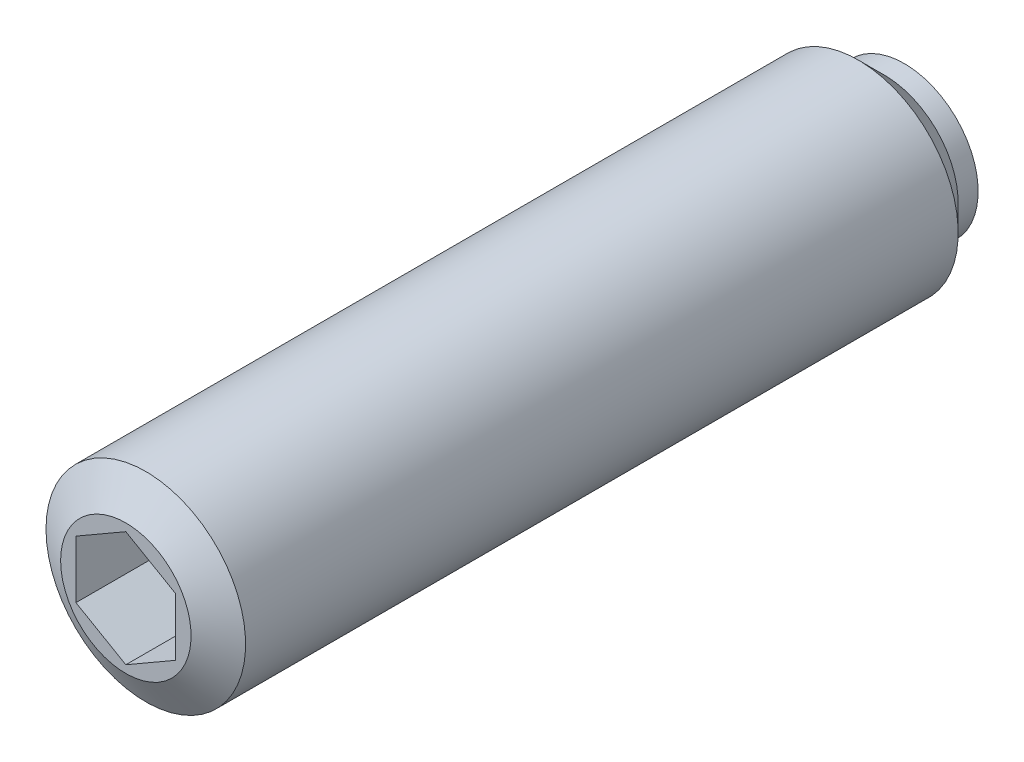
ISO-10303-21;
HEADER;
FILE_DESCRIPTION(('STEP AP214'),'2;1');
FILE_NAME('part.step','',(''),(''),'','','');
FILE_SCHEMA(('AUTOMOTIVE_DESIGN { 1 0 10303 214 1 1 1 1 }'));
ENDSEC;
DATA;
#1=APPLICATION_CONTEXT('core data for automotive mechanical design processes');
#2=APPLICATION_PROTOCOL_DEFINITION('international standard','automotive_design',2000,#1);
#3=PRODUCT_CONTEXT('',#1,'mechanical');
#4=PRODUCT('Part','Part','',(#3));
#5=PRODUCT_RELATED_PRODUCT_CATEGORY('part','',(#4));
#6=PRODUCT_DEFINITION_FORMATION('','',#4);
#7=PRODUCT_DEFINITION_CONTEXT('part definition',#1,'design');
#8=PRODUCT_DEFINITION('design','',#6,#7);
#9=PRODUCT_DEFINITION_SHAPE('','',#8);
#10=(LENGTH_UNIT() NAMED_UNIT(*) SI_UNIT(.MILLI.,.METRE.));
#11=(NAMED_UNIT(*) PLANE_ANGLE_UNIT() SI_UNIT($,.RADIAN.));
#12=(NAMED_UNIT(*) SI_UNIT($,.STERADIAN.) SOLID_ANGLE_UNIT());
#13=UNCERTAINTY_MEASURE_WITH_UNIT(LENGTH_MEASURE(1.E-05),#10,'distance_accuracy_value','');
#14=(GEOMETRIC_REPRESENTATION_CONTEXT(3) GLOBAL_UNCERTAINTY_ASSIGNED_CONTEXT((#13)) GLOBAL_UNIT_ASSIGNED_CONTEXT((#10,
#11,#12)) REPRESENTATION_CONTEXT('',''));
#15=CARTESIAN_POINT('',(0.,0.,0.));
#16=DIRECTION('',(0.,0.,1.));
#17=DIRECTION('',(1.,0.,0.));
#18=AXIS2_PLACEMENT_3D('',#15,#16,#17);
#19=CARTESIAN_POINT('',(0.,1.01980390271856,0.));
#20=DIRECTION('',(0.,0.,1.));
#21=DIRECTION('',(-1.,0.,0.));
#22=AXIS2_PLACEMENT_3D('',#19,#20,#21);
#23=PLANE('',#22);
#24=CARTESIAN_POINT('',(0.,0.,0.));
#25=DIRECTION('',(0.,0.,1.));
#26=DIRECTION('',(-1.,0.,0.));
#27=AXIS2_PLACEMENT_3D('',#24,#25,#26);
#28=CIRCLE('',#27,1.01980390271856);
#29=CARTESIAN_POINT('',(0.,1.01980390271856,0.));
#30=VERTEX_POINT('',#29);
#31=EDGE_CURVE('E9',#30,#30,#28,.T.);
#32=ORIENTED_EDGE('',*,*,#31,.F.);
#33=EDGE_LOOP('',(#32));
#34=FACE_BOUND('',#33,.T.);
#35=ADVANCED_FACE('F14',(#34),#23,.F.);
#36=CARTESIAN_POINT('',(0.,0.,1.1));
#37=DIRECTION('',(0.,0.,1.));
#38=DIRECTION('',(0.,1.,0.));
#39=AXIS2_PLACEMENT_3D('',#36,#37,#38);
#40=SPHERICAL_SURFACE('',#39,1.5);
#41=CARTESIAN_POINT('',(0.,0.,0.3));
#42=DIRECTION('',(0.,0.,1.));
#43=DIRECTION('',(-1.,0.,0.));
#44=AXIS2_PLACEMENT_3D('',#41,#42,#43);
#45=CIRCLE('',#44,1.26885775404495);
#46=CARTESIAN_POINT('',(0.,1.26885775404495,0.3));
#47=VERTEX_POINT('',#46);
#48=EDGE_CURVE('E21',#47,#47,#45,.T.);
#49=CARTESIAN_POINT('',(0.,1.26885775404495,0.3));
#50=CARTESIAN_POINT('',(0.,1.26668545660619,0.296554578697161));
#51=CARTESIAN_POINT('',(0.,1.26449912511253,0.293118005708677));
#52=CARTESIAN_POINT('',(0.,1.26009854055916,0.286262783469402));
#53=CARTESIAN_POINT('',(0.,1.25788428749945,0.28284413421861));
#54=CARTESIAN_POINT('',(0.,1.25342800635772,0.276024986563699));
#55=CARTESIAN_POINT('',(0.,1.2511859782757,0.27262448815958));
#56=CARTESIAN_POINT('',(0.,1.24667429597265,0.265841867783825));
#57=CARTESIAN_POINT('',(0.,1.24440464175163,0.26245974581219));
#58=CARTESIAN_POINT('',(0.,1.23983785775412,0.255714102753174));
#59=CARTESIAN_POINT('',(0.,1.23754072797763,0.252350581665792));
#60=CARTESIAN_POINT('',(0.,1.23291914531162,0.245642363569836));
#61=CARTESIAN_POINT('',(0.,1.23059469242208,0.242297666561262));
#62=CARTESIAN_POINT('',(0.,1.22591861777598,0.235627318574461));
#63=CARTESIAN_POINT('',(0.,1.2235669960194,0.232301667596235));
#64=CARTESIAN_POINT('',(0.,1.21883673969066,0.225669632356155));
#65=CARTESIAN_POINT('',(0.,1.2164581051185,0.222363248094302));
#66=CARTESIAN_POINT('',(0.,1.21167398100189,0.215769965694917));
#67=CARTESIAN_POINT('',(0.,1.20926849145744,0.212483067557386));
#68=CARTESIAN_POINT('',(0.,1.20443081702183,0.205928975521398));
#69=CARTESIAN_POINT('',(0.,1.20199863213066,0.202661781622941));
#70=CARTESIAN_POINT('',(0.,1.19710772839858,0.196147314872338));
#71=CARTESIAN_POINT('',(0.,1.19464900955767,0.192900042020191));
#72=CARTESIAN_POINT('',(0.,1.18970520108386,0.186425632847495));
#73=CARTESIAN_POINT('',(0.,1.18722011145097,0.183198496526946));
#74=CARTESIAN_POINT('',(0.,1.18222372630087,0.176764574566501));
#75=CARTESIAN_POINT('',(0.,1.17971243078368,0.173557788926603));
#76=CARTESIAN_POINT('',(0.,1.17466380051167,0.167164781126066));
#77=CARTESIAN_POINT('',(0.,1.17212646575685,0.163978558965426));
#78=CARTESIAN_POINT('',(0.,1.16702592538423,0.157626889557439));
#79=CARTESIAN_POINT('',(0.,1.16446271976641,0.154461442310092));
#80=CARTESIAN_POINT('',(0.,1.15931060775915,0.148151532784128));
#81=CARTESIAN_POINT('',(0.,1.15672170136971,0.145007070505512));
#82=CARTESIAN_POINT('',(0.,1.15151835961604,0.138739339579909));
#83=CARTESIAN_POINT('',(0.,1.14890392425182,0.135616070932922));
#84=CARTESIAN_POINT('',(0.,1.14364969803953,0.129390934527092));
#85=CARTESIAN_POINT('',(0.,1.14100990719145,0.126289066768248));
#86=CARTESIAN_POINT('',(0.,1.13570514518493,0.120106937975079));
#87=CARTESIAN_POINT('',(0.,1.13304017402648,0.117026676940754));
#88=CARTESIAN_POINT('',(0.,1.12768522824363,0.1108879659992));
#89=CARTESIAN_POINT('',(0.,1.12499525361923,0.107829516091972));
#90=CARTESIAN_POINT('',(0.,1.1195904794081,0.101734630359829));
#91=CARTESIAN_POINT('',(0.,1.11687567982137,0.0986981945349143));
#92=CARTESIAN_POINT('',(0.,1.11142143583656,0.0926475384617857));
#93=CARTESIAN_POINT('',(0.,1.10868199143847,0.0896333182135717));
#94=CARTESIAN_POINT('',(0.,1.10317863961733,0.0836272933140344));
#95=CARTESIAN_POINT('',(0.,1.10041473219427,0.080635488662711));
#96=CARTESIAN_POINT('',(0.,1.09486263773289,0.0746744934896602));
#97=CARTESIAN_POINT('',(0.,1.09207445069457,0.0717053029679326));
#98=CARTESIAN_POINT('',(0.,1.08647398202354,0.0657897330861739));
#99=CARTESIAN_POINT('',(0.,1.08366170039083,0.0628433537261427));
#100=CARTESIAN_POINT('',(0.,1.07801322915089,0.0569736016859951));
#101=CARTESIAN_POINT('',(0.,1.07517703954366,0.0540502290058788));
#102=CARTESIAN_POINT('',(0.,1.06948094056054,0.0482266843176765));
#103=CARTESIAN_POINT('',(0.,1.06662103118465,0.0453265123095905));
#104=CARTESIAN_POINT('',(0.,1.06087768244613,0.0395495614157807));
#105=CARTESIAN_POINT('',(0.,1.0579942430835,0.036672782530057));
#106=CARTESIAN_POINT('',(0.,1.0522040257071,0.0309428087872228));
#107=CARTESIAN_POINT('',(0.,1.04929724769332,0.0280896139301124));
#108=CARTESIAN_POINT('',(0.,1.04346054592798,0.0224069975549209));
#109=CARTESIAN_POINT('',(0.,1.0405306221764,0.01957757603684));
#110=CARTESIAN_POINT('',(0.,1.03464782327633,0.013942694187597));
#111=CARTESIAN_POINT('',(0.,1.03169494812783,0.011137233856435));
#112=CARTESIAN_POINT('',(0.,1.02576644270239,0.00555046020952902));
#113=CARTESIAN_POINT('',(0.,1.02279081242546,0.00276914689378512));
#114=CARTESIAN_POINT('',(0.,1.01980390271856,0.));
#115=B_SPLINE_CURVE_WITH_KNOTS('',3,(#49,#50,#51,#52,#53,#54,#55,#56,#57,#58,#59,#60,#61,#62,
#63,#64,#65,#66,#67,#68,#69,#70,#71,#72,#73,#74,#75,#76,#77,#78,#79,#80,#81,#82,#83,#84,#85,#86,
#87,#88,#89,#90,#91,#92,#93,#94,#95,#96,#97,#98,#99,#100,#101,#102,#103,#104,#105,#106,#107,
#108,#109,#110,#111,#112,#113,#114),.UNSPECIFIED.,.F.,.F.,(4,2,2,2,2,2,2,2,2,2,2,2,2,2,2,2,2,2,
2,2,2,2,2,2,2,2,2,2,2,2,2,2,4),(0.,0.0122191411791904,0.0244382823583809,0.0366574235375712,
0.0488765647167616,0.061095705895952,0.0733148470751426,0.0855339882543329,0.0977531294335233,
0.109972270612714,0.122191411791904,0.134410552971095,0.146629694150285,0.158848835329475,
0.171067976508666,0.183287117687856,0.195506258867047,0.207725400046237,0.219944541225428,
0.232163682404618,0.244382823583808,0.256601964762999,0.268821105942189,0.281040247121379,
0.29325938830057,0.30547852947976,0.317697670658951,0.329916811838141,0.342135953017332,
0.354355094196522,0.366574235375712,0.378793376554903,0.391012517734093),.UNSPECIFIED.);
#116=EDGE_CURVE('BSEAM141',#47,#30,#115,.T.);
#117=ORIENTED_EDGE('',*,*,#48,.F.);
#118=ORIENTED_EDGE('',*,*,#31,.T.);
#119=ORIENTED_EDGE('',*,*,#116,.T.);
#120=ORIENTED_EDGE('',*,*,#116,.F.);
#121=EDGE_LOOP('',(#117,#119,#118,#120));
#122=FACE_BOUND('',#121,.T.);
#123=ADVANCED_FACE('F141',(#122),#40,.T.);
#124=CARTESIAN_POINT('',(0.,1.85,0.3));
#125=DIRECTION('',(0.,0.,1.));
#126=DIRECTION('',(-1.,0.,0.));
#127=AXIS2_PLACEMENT_3D('',#124,#125,#126);
#128=PLANE('',#127);
#129=CARTESIAN_POINT('',(0.,0.,0.3));
#130=DIRECTION('',(0.,0.,1.));
#131=DIRECTION('',(-1.,0.,0.));
#132=AXIS2_PLACEMENT_3D('',#129,#130,#131);
#133=CIRCLE('',#132,1.85);
#134=CARTESIAN_POINT('',(-1.85,0.,0.3));
#135=VERTEX_POINT('',#134);
#136=EDGE_CURVE('E134',#135,#135,#133,.T.);
#137=ORIENTED_EDGE('',*,*,#136,.F.);
#138=EDGE_LOOP('',(#137));
#139=FACE_BOUND('',#138,.T.);
#140=ORIENTED_EDGE('',*,*,#48,.T.);
#141=EDGE_LOOP('',(#140));
#142=FACE_BOUND('',#141,.T.);
#143=ADVANCED_FACE('F139',(#139,#142),#128,.F.);
#144=CARTESIAN_POINT('',(0.,0.,21.1950749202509));
#145=DIRECTION('',(0.,0.,1.));
#146=DIRECTION('',(-1.,0.,0.));
#147=AXIS2_PLACEMENT_3D('',#144,#145,#146);
#148=CYLINDRICAL_SURFACE('',#147,1.85);
#149=CARTESIAN_POINT('',(0.,0.,0.8));
#150=DIRECTION('',(0.,0.,1.));
#151=DIRECTION('',(-1.,0.,0.));
#152=AXIS2_PLACEMENT_3D('',#149,#150,#151);
#153=CIRCLE('',#152,1.85);
#154=CARTESIAN_POINT('',(-1.85,0.,0.8));
#155=VERTEX_POINT('',#154);
#156=EDGE_CURVE('E131',#155,#155,#153,.T.);
#157=ORIENTED_EDGE('',*,*,#156,.F.);
#158=EDGE_LOOP('',(#157));
#159=FACE_BOUND('',#158,.T.);
#160=ORIENTED_EDGE('',*,*,#136,.T.);
#161=EDGE_LOOP('',(#160));
#162=FACE_BOUND('',#161,.T.);
#163=ADVANCED_FACE('F164',(#159,#162),#148,.T.);
#164=CARTESIAN_POINT('',(0.,0.,0.8));
#165=DIRECTION('',(0.,0.,1.));
#166=DIRECTION('',(-1.,0.,0.));
#167=AXIS2_PLACEMENT_3D('',#164,#165,#166);
#168=CONICAL_SURFACE('',#167,1.85,0.785398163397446);
#169=CARTESIAN_POINT('',(0.,0.,1.45));
#170=DIRECTION('',(0.,0.,1.));
#171=DIRECTION('',(-1.,0.,0.));
#172=AXIS2_PLACEMENT_3D('',#169,#170,#171);
#173=CIRCLE('',#172,2.5);
#174=CARTESIAN_POINT('',(-2.5,0.,1.45));
#175=VERTEX_POINT('',#174);
#176=EDGE_CURVE('E128',#175,#175,#173,.T.);
#177=ORIENTED_EDGE('',*,*,#176,.F.);
#178=EDGE_LOOP('',(#177));
#179=FACE_BOUND('',#178,.T.);
#180=ORIENTED_EDGE('',*,*,#156,.T.);
#181=EDGE_LOOP('',(#180));
#182=FACE_BOUND('',#181,.T.);
#183=ADVANCED_FACE('F173',(#179,#182),#168,.T.);
#184=CARTESIAN_POINT('',(0.,0.,21.1950749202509));
#185=DIRECTION('',(0.,0.,1.));
#186=DIRECTION('',(-1.,0.,0.));
#187=AXIS2_PLACEMENT_3D('',#184,#185,#186);
#188=CYLINDRICAL_SURFACE('',#187,2.5);
#189=CARTESIAN_POINT('',(0.,0.,19.3));
#190=DIRECTION('',(0.,0.,1.));
#191=DIRECTION('',(-1.,0.,0.));
#192=AXIS2_PLACEMENT_3D('',#189,#190,#191);
#193=CIRCLE('',#192,2.5);
#194=CARTESIAN_POINT('',(-2.5,0.,19.3));
#195=VERTEX_POINT('',#194);
#196=EDGE_CURVE('E125',#195,#195,#193,.T.);
#197=ORIENTED_EDGE('',*,*,#196,.F.);
#198=EDGE_LOOP('',(#197));
#199=FACE_BOUND('',#198,.T.);
#200=ORIENTED_EDGE('',*,*,#176,.T.);
#201=EDGE_LOOP('',(#200));
#202=FACE_BOUND('',#201,.T.);
#203=ADVANCED_FACE('F182',(#199,#202),#188,.T.);
#204=CARTESIAN_POINT('',(0.,0.,19.3));
#205=DIRECTION('',(0.,0.,-1.));
#206=DIRECTION('',(1.,0.,0.));
#207=AXIS2_PLACEMENT_3D('',#204,#205,#206);
#208=CONICAL_SURFACE('',#207,2.5,1.04719755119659);
#209=CARTESIAN_POINT('',(0.,0.,19.8));
#210=DIRECTION('',(0.,0.,1.));
#211=DIRECTION('',(-1.,0.,0.));
#212=AXIS2_PLACEMENT_3D('',#209,#210,#211);
#213=CIRCLE('',#212,1.63397459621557);
#214=CARTESIAN_POINT('',(-1.63397459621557,0.,19.8));
#215=VERTEX_POINT('',#214);
#216=EDGE_CURVE('E116',#215,#215,#213,.T.);
#217=ORIENTED_EDGE('',*,*,#216,.F.);
#218=EDGE_LOOP('',(#217));
#219=FACE_BOUND('',#218,.T.);
#220=ORIENTED_EDGE('',*,*,#196,.T.);
#221=EDGE_LOOP('',(#220));
#222=FACE_BOUND('',#221,.T.);
#223=ADVANCED_FACE('F191',(#219,#222),#208,.T.);
#224=CARTESIAN_POINT('',(0.,0.,19.8));
#225=DIRECTION('',(0.,0.,-1.));
#226=DIRECTION('',(1.,0.,0.));
#227=AXIS2_PLACEMENT_3D('',#224,#225,#226);
#228=PLANE('',#227);
#229=DIRECTION('',(-0.866025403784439,-0.5,0.));
#230=VECTOR('',#229,1.);
#231=CARTESIAN_POINT('',(0.,1.44337567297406,19.8));
#232=LINE('',#231,#230);
#233=CARTESIAN_POINT('',(0.,1.44337567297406,19.8));
#234=VERTEX_POINT('',#233);
#235=CARTESIAN_POINT('',(-1.25,0.721687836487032,19.8));
#236=VERTEX_POINT('',#235);
#237=EDGE_CURVE('E82',#234,#236,#232,.T.);
#238=ORIENTED_EDGE('',*,*,#237,.F.);
#239=DIRECTION('',(-0.866025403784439,0.5,0.));
#240=VECTOR('',#239,1.);
#241=CARTESIAN_POINT('',(1.25,0.721687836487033,19.8));
#242=LINE('',#241,#240);
#243=CARTESIAN_POINT('',(1.25,0.721687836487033,19.8));
#244=VERTEX_POINT('',#243);
#245=EDGE_CURVE('E28',#244,#234,#242,.T.);
#246=ORIENTED_EDGE('',*,*,#245,.F.);
#247=DIRECTION('',(0.,1.,0.));
#248=VECTOR('',#247,1.);
#249=CARTESIAN_POINT('',(1.25,-0.721687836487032,19.8));
#250=LINE('',#249,#248);
#251=CARTESIAN_POINT('',(1.25,-0.721687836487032,19.8));
#252=VERTEX_POINT('',#251);
#253=EDGE_CURVE('E98',#252,#244,#250,.T.);
#254=ORIENTED_EDGE('',*,*,#253,.F.);
#255=DIRECTION('',(0.866025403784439,0.5,0.));
#256=VECTOR('',#255,1.);
#257=CARTESIAN_POINT('',(0.,-1.44337567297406,19.8));
#258=LINE('',#257,#256);
#259=CARTESIAN_POINT('',(0.,-1.44337567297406,19.8));
#260=VERTEX_POINT('',#259);
#261=EDGE_CURVE('E92',#260,#252,#258,.T.);
#262=ORIENTED_EDGE('',*,*,#261,.F.);
#263=DIRECTION('',(0.866025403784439,-0.5,0.));
#264=VECTOR('',#263,1.);
#265=CARTESIAN_POINT('',(-1.25,-0.721687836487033,19.8));
#266=LINE('',#265,#264);
#267=CARTESIAN_POINT('',(-1.25,-0.721687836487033,19.8));
#268=VERTEX_POINT('',#267);
#269=EDGE_CURVE('E90',#268,#260,#266,.T.);
#270=ORIENTED_EDGE('',*,*,#269,.F.);
#271=DIRECTION('',(0.,-1.,0.));
#272=VECTOR('',#271,1.);
#273=CARTESIAN_POINT('',(-1.25,0.721687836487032,19.8));
#274=LINE('',#273,#272);
#275=EDGE_CURVE('E71',#236,#268,#274,.T.);
#276=ORIENTED_EDGE('',*,*,#275,.F.);
#277=EDGE_LOOP('',(#238,#246,#254,#262,#270,#276));
#278=FACE_BOUND('',#277,.T.);
#279=ORIENTED_EDGE('',*,*,#216,.T.);
#280=EDGE_LOOP('',(#279));
#281=FACE_BOUND('',#280,.T.);
#282=ADVANCED_FACE('F86',(#278,#281),#228,.F.);
#283=CARTESIAN_POINT('',(1.25,0.721687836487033,16.8));
#284=DIRECTION('',(0.5,0.866025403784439,0.));
#285=DIRECTION('',(0.866025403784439,-0.5,0.));
#286=AXIS2_PLACEMENT_3D('',#283,#284,#285);
#287=PLANE('',#286);
#288=ORIENTED_EDGE('',*,*,#245,.T.);
#289=DIRECTION('',(0.,0.,1.));
#290=VECTOR('',#289,1.);
#291=CARTESIAN_POINT('',(0.,1.44337567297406,16.8));
#292=LINE('',#291,#290);
#293=CARTESIAN_POINT('',(0.,1.44337567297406,16.8));
#294=VERTEX_POINT('',#293);
#295=EDGE_CURVE('E79',#294,#234,#292,.T.);
#296=ORIENTED_EDGE('',*,*,#295,.F.);
#297=DIRECTION('',(-0.866025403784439,0.5,0.));
#298=VECTOR('',#297,1.);
#299=CARTESIAN_POINT('',(1.25,0.721687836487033,16.8));
#300=LINE('',#299,#298);
#301=CARTESIAN_POINT('',(1.25,0.721687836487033,16.8));
#302=VERTEX_POINT('',#301);
#303=EDGE_CURVE('E100',#302,#294,#300,.T.);
#304=ORIENTED_EDGE('',*,*,#303,.F.);
#305=DIRECTION('',(0.,0.,1.));
#306=VECTOR('',#305,1.);
#307=CARTESIAN_POINT('',(1.25,0.721687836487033,16.8));
#308=LINE('',#307,#306);
#309=EDGE_CURVE('E35',#302,#244,#308,.T.);
#310=ORIENTED_EDGE('',*,*,#309,.T.);
#311=EDGE_LOOP('',(#288,#296,#304,#310));
#312=FACE_BOUND('',#311,.T.);
#313=ADVANCED_FACE('F208',(#312),#287,.F.);
#314=CARTESIAN_POINT('',(1.25,-0.721687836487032,16.8));
#315=DIRECTION('',(1.,0.,0.));
#316=DIRECTION('',(0.,-1.,0.));
#317=AXIS2_PLACEMENT_3D('',#314,#315,#316);
#318=PLANE('',#317);
#319=ORIENTED_EDGE('',*,*,#253,.T.);
#320=ORIENTED_EDGE('',*,*,#309,.F.);
#321=DIRECTION('',(0.,1.,0.));
#322=VECTOR('',#321,1.);
#323=CARTESIAN_POINT('',(1.25,-0.721687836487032,16.8));
#324=LINE('',#323,#322);
#325=CARTESIAN_POINT('',(1.25,-0.721687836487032,16.8));
#326=VERTEX_POINT('',#325);
#327=EDGE_CURVE('E112',#326,#302,#324,.T.);
#328=ORIENTED_EDGE('',*,*,#327,.F.);
#329=DIRECTION('',(0.,0.,1.));
#330=VECTOR('',#329,1.);
#331=CARTESIAN_POINT('',(1.25,-0.721687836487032,16.8));
#332=LINE('',#331,#330);
#333=EDGE_CURVE('E117',#326,#252,#332,.T.);
#334=ORIENTED_EDGE('',*,*,#333,.T.);
#335=EDGE_LOOP('',(#319,#320,#328,#334));
#336=FACE_BOUND('',#335,.T.);
#337=ADVANCED_FACE('F216',(#336),#318,.F.);
#338=CARTESIAN_POINT('',(0.,-1.44337567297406,16.8));
#339=DIRECTION('',(0.5,-0.866025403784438,0.));
#340=DIRECTION('',(-0.866025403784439,-0.5,0.));
#341=AXIS2_PLACEMENT_3D('',#338,#339,#340);
#342=PLANE('',#341);
#343=ORIENTED_EDGE('',*,*,#261,.T.);
#344=ORIENTED_EDGE('',*,*,#333,.F.);
#345=DIRECTION('',(0.866025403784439,0.5,0.));
#346=VECTOR('',#345,1.);
#347=CARTESIAN_POINT('',(0.,-1.44337567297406,16.8));
#348=LINE('',#347,#346);
#349=CARTESIAN_POINT('',(0.,-1.44337567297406,16.8));
#350=VERTEX_POINT('',#349);
#351=EDGE_CURVE('E109',#350,#326,#348,.T.);
#352=ORIENTED_EDGE('',*,*,#351,.F.);
#353=DIRECTION('',(0.,0.,1.));
#354=VECTOR('',#353,1.);
#355=CARTESIAN_POINT('',(0.,-1.44337567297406,16.8));
#356=LINE('',#355,#354);
#357=EDGE_CURVE('E119',#350,#260,#356,.T.);
#358=ORIENTED_EDGE('',*,*,#357,.T.);
#359=EDGE_LOOP('',(#343,#344,#352,#358));
#360=FACE_BOUND('',#359,.T.);
#361=ADVANCED_FACE('F224',(#360),#342,.F.);
#362=CARTESIAN_POINT('',(-1.25,-0.721687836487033,16.8));
#363=DIRECTION('',(-0.5,-0.866025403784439,0.));
#364=DIRECTION('',(-0.866025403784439,0.5,0.));
#365=AXIS2_PLACEMENT_3D('',#362,#363,#364);
#366=PLANE('',#365);
#367=ORIENTED_EDGE('',*,*,#269,.T.);
#368=ORIENTED_EDGE('',*,*,#357,.F.);
#369=DIRECTION('',(0.866025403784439,-0.5,0.));
#370=VECTOR('',#369,1.);
#371=CARTESIAN_POINT('',(-1.25,-0.721687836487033,16.8));
#372=LINE('',#371,#370);
#373=CARTESIAN_POINT('',(-1.25,-0.721687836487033,16.8));
#374=VERTEX_POINT('',#373);
#375=EDGE_CURVE('E106',#374,#350,#372,.T.);
#376=ORIENTED_EDGE('',*,*,#375,.F.);
#377=DIRECTION('',(0.,0.,1.));
#378=VECTOR('',#377,1.);
#379=CARTESIAN_POINT('',(-1.25,-0.721687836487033,16.8));
#380=LINE('',#379,#378);
#381=EDGE_CURVE('E78',#374,#268,#380,.T.);
#382=ORIENTED_EDGE('',*,*,#381,.T.);
#383=EDGE_LOOP('',(#367,#368,#376,#382));
#384=FACE_BOUND('',#383,.T.);
#385=ADVANCED_FACE('F232',(#384),#366,.F.);
#386=CARTESIAN_POINT('',(-1.25,0.721687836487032,16.8));
#387=DIRECTION('',(-1.,0.,0.));
#388=DIRECTION('',(0.,1.,0.));
#389=AXIS2_PLACEMENT_3D('',#386,#387,#388);
#390=PLANE('',#389);
#391=ORIENTED_EDGE('',*,*,#275,.T.);
#392=ORIENTED_EDGE('',*,*,#381,.F.);
#393=DIRECTION('',(0.,-1.,0.));
#394=VECTOR('',#393,1.);
#395=CARTESIAN_POINT('',(-1.25,0.721687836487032,16.8));
#396=LINE('',#395,#394);
#397=CARTESIAN_POINT('',(-1.25,0.721687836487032,16.8));
#398=VERTEX_POINT('',#397);
#399=EDGE_CURVE('E74',#398,#374,#396,.T.);
#400=ORIENTED_EDGE('',*,*,#399,.F.);
#401=DIRECTION('',(0.,0.,1.));
#402=VECTOR('',#401,1.);
#403=CARTESIAN_POINT('',(-1.25,0.721687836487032,16.8));
#404=LINE('',#403,#402);
#405=EDGE_CURVE('E67',#398,#236,#404,.T.);
#406=ORIENTED_EDGE('',*,*,#405,.T.);
#407=EDGE_LOOP('',(#391,#392,#400,#406));
#408=FACE_BOUND('',#407,.T.);
#409=ADVANCED_FACE('F69',(#408),#390,.F.);
#410=CARTESIAN_POINT('',(0.,1.44337567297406,16.8));
#411=DIRECTION('',(-0.5,0.866025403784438,0.));
#412=DIRECTION('',(0.866025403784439,0.5,0.));
#413=AXIS2_PLACEMENT_3D('',#410,#411,#412);
#414=PLANE('',#413);
#415=ORIENTED_EDGE('',*,*,#237,.T.);
#416=ORIENTED_EDGE('',*,*,#405,.F.);
#417=DIRECTION('',(-0.866025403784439,-0.5,0.));
#418=VECTOR('',#417,1.);
#419=CARTESIAN_POINT('',(0.,1.44337567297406,16.8));
#420=LINE('',#419,#418);
#421=EDGE_CURVE('E103',#294,#398,#420,.T.);
#422=ORIENTED_EDGE('',*,*,#421,.F.);
#423=ORIENTED_EDGE('',*,*,#295,.T.);
#424=EDGE_LOOP('',(#415,#416,#422,#423));
#425=FACE_BOUND('',#424,.T.);
#426=ADVANCED_FACE('F83',(#425),#414,.F.);
#427=CARTESIAN_POINT('',(2.5,0.,16.8));
#428=DIRECTION('',(0.,0.,-1.));
#429=DIRECTION('',(1.,0.,0.));
#430=AXIS2_PLACEMENT_3D('',#427,#428,#429);
#431=PLANE('',#430);
#432=ORIENTED_EDGE('',*,*,#303,.T.);
#433=ORIENTED_EDGE('',*,*,#421,.T.);
#434=ORIENTED_EDGE('',*,*,#399,.T.);
#435=ORIENTED_EDGE('',*,*,#375,.T.);
#436=ORIENTED_EDGE('',*,*,#351,.T.);
#437=ORIENTED_EDGE('',*,*,#327,.T.);
#438=EDGE_LOOP('',(#432,#433,#434,#435,#436,#437));
#439=FACE_BOUND('',#438,.T.);
#440=ADVANCED_FACE('F256',(#439),#431,.F.);
#441=CLOSED_SHELL('',(#35,#123,#143,#163,#183,#203,#223,#282,#313,#337,#361,#385,#409,#426,#440));
#442=MANIFOLD_SOLID_BREP('B1',#441);
#443=ADVANCED_BREP_SHAPE_REPRESENTATION('',(#18,#442),#14);
#444=SHAPE_DEFINITION_REPRESENTATION(#9,#443);
ENDSEC;
END-ISO-10303-21;
